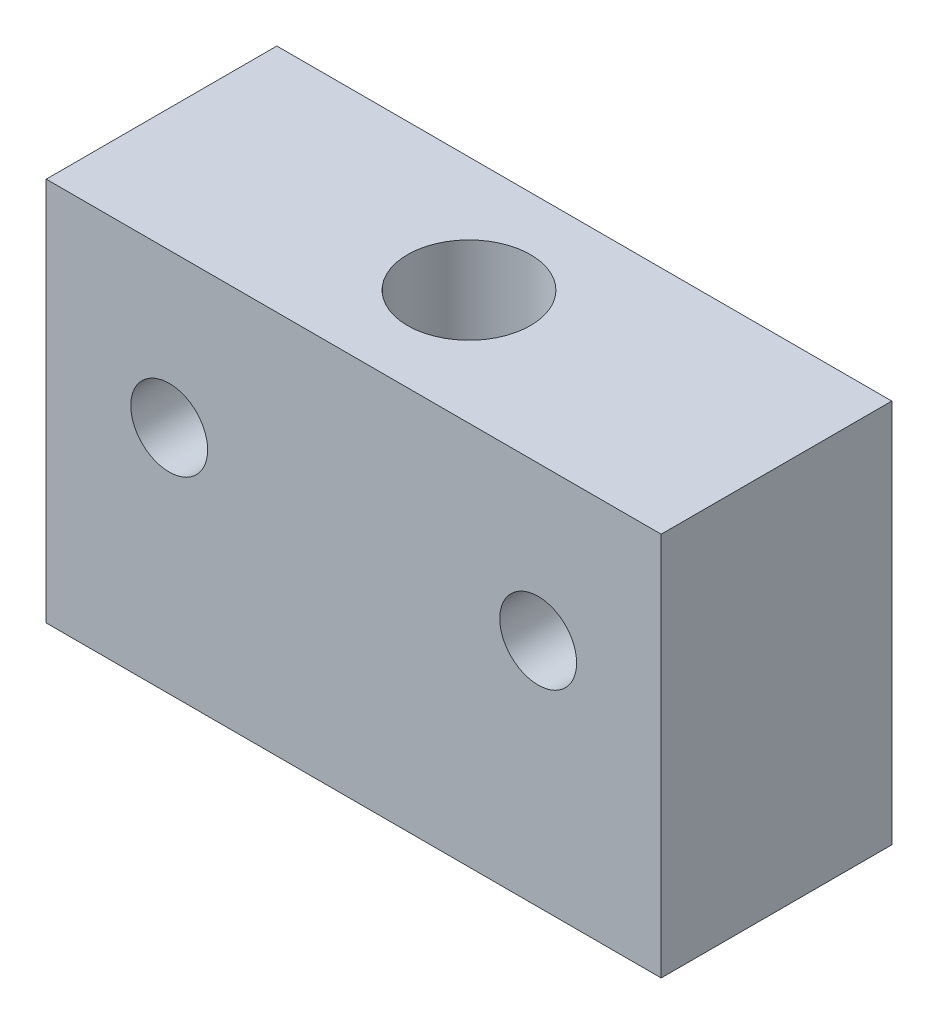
ISO-10303-21;
HEADER;
FILE_DESCRIPTION(('STEP AP214'),'2;1');
FILE_NAME('part.step','',(''),(''),'','','');
FILE_SCHEMA(('AUTOMOTIVE_DESIGN { 1 0 10303 214 1 1 1 1 }'));
ENDSEC;
DATA;
#1=APPLICATION_CONTEXT('core data for automotive mechanical design processes');
#2=APPLICATION_PROTOCOL_DEFINITION('international standard','automotive_design',2000,#1);
#3=PRODUCT_CONTEXT('',#1,'mechanical');
#4=PRODUCT('Part','Part','',(#3));
#5=PRODUCT_RELATED_PRODUCT_CATEGORY('part','',(#4));
#6=PRODUCT_DEFINITION_FORMATION('','',#4);
#7=PRODUCT_DEFINITION_CONTEXT('part definition',#1,'design');
#8=PRODUCT_DEFINITION('design','',#6,#7);
#9=PRODUCT_DEFINITION_SHAPE('','',#8);
#10=(LENGTH_UNIT() NAMED_UNIT(*) SI_UNIT(.MILLI.,.METRE.));
#11=(NAMED_UNIT(*) PLANE_ANGLE_UNIT() SI_UNIT($,.RADIAN.));
#12=(NAMED_UNIT(*) SI_UNIT($,.STERADIAN.) SOLID_ANGLE_UNIT());
#13=UNCERTAINTY_MEASURE_WITH_UNIT(LENGTH_MEASURE(1.E-05),#10,'distance_accuracy_value','');
#14=(GEOMETRIC_REPRESENTATION_CONTEXT(3) GLOBAL_UNCERTAINTY_ASSIGNED_CONTEXT((#13)) GLOBAL_UNIT_ASSIGNED_CONTEXT((#10,
#11,#12)) REPRESENTATION_CONTEXT('',''));
#15=CARTESIAN_POINT('',(0.,0.,0.));
#16=DIRECTION('',(0.,0.,1.));
#17=DIRECTION('',(1.,0.,0.));
#18=AXIS2_PLACEMENT_3D('',#15,#16,#17);
#19=CARTESIAN_POINT('',(-69.9731301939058,23.6234072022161,15.));
#20=DIRECTION('',(1.,0.,0.));
#21=DIRECTION('',(0.,0.,-1.));
#22=AXIS2_PLACEMENT_3D('',#19,#20,#21);
#23=PLANE('',#22);
#24=DIRECTION('',(0.,-1.,0.));
#25=VECTOR('',#24,1.);
#26=CARTESIAN_POINT('',(-69.9731301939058,23.6234072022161,0.));
#27=LINE('',#26,#25);
#28=CARTESIAN_POINT('',(-69.9731301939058,23.6234072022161,0.));
#29=VERTEX_POINT('',#28);
#30=CARTESIAN_POINT('',(-69.9731301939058,-1.37659279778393,0.));
#31=VERTEX_POINT('',#30);
#32=EDGE_CURVE('E70',#29,#31,#27,.T.);
#33=ORIENTED_EDGE('',*,*,#32,.T.);
#34=DIRECTION('',(0.,0.,-1.));
#35=VECTOR('',#34,1.);
#36=CARTESIAN_POINT('',(-69.9731301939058,-1.37659279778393,15.));
#37=LINE('',#36,#35);
#38=CARTESIAN_POINT('',(-69.9731301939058,-1.37659279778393,15.));
#39=VERTEX_POINT('',#38);
#40=EDGE_CURVE('E11',#39,#31,#37,.T.);
#41=ORIENTED_EDGE('',*,*,#40,.F.);
#42=DIRECTION('',(0.,-1.,0.));
#43=VECTOR('',#42,1.);
#44=CARTESIAN_POINT('',(-69.9731301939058,23.6234072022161,15.));
#45=LINE('',#44,#43);
#46=CARTESIAN_POINT('',(-69.9731301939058,23.6234072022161,15.));
#47=VERTEX_POINT('',#46);
#48=EDGE_CURVE('E93',#47,#39,#45,.T.);
#49=ORIENTED_EDGE('',*,*,#48,.F.);
#50=DIRECTION('',(0.,0.,-1.));
#51=VECTOR('',#50,1.);
#52=CARTESIAN_POINT('',(-69.9731301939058,23.6234072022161,15.));
#53=LINE('',#52,#51);
#54=EDGE_CURVE('E82',#47,#29,#53,.T.);
#55=ORIENTED_EDGE('',*,*,#54,.T.);
#56=EDGE_LOOP('',(#33,#41,#49,#55));
#57=FACE_BOUND('',#56,.T.);
#58=ADVANCED_FACE('F24',(#57),#23,.F.);
#59=CARTESIAN_POINT('',(-69.9731301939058,-1.37659279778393,15.));
#60=DIRECTION('',(0.,1.,0.));
#61=DIRECTION('',(0.,0.,1.));
#62=AXIS2_PLACEMENT_3D('',#59,#60,#61);
#63=PLANE('',#62);
#64=CARTESIAN_POINT('',(-49.9731301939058,-1.37659279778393,7.50000000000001));
#65=DIRECTION('',(0.,1.,0.));
#66=DIRECTION('',(0.,0.,1.));
#67=AXIS2_PLACEMENT_3D('',#64,#65,#66);
#68=CIRCLE('',#67,4.);
#69=CARTESIAN_POINT('',(-49.9731301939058,-1.37659279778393,11.5));
#70=VERTEX_POINT('',#69);
#71=EDGE_CURVE('E83',#70,#70,#68,.T.);
#72=ORIENTED_EDGE('',*,*,#71,.T.);
#73=EDGE_LOOP('',(#72));
#74=FACE_BOUND('',#73,.T.);
#75=DIRECTION('',(1.,0.,0.));
#76=VECTOR('',#75,1.);
#77=CARTESIAN_POINT('',(-69.9731301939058,-1.37659279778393,0.));
#78=LINE('',#77,#76);
#79=CARTESIAN_POINT('',(-29.9731301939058,-1.37659279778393,0.));
#80=VERTEX_POINT('',#79);
#81=EDGE_CURVE('E66',#31,#80,#78,.T.);
#82=ORIENTED_EDGE('',*,*,#81,.T.);
#83=DIRECTION('',(0.,0.,-1.));
#84=VECTOR('',#83,1.);
#85=CARTESIAN_POINT('',(-29.9731301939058,-1.37659279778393,15.));
#86=LINE('',#85,#84);
#87=CARTESIAN_POINT('',(-29.9731301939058,-1.37659279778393,15.));
#88=VERTEX_POINT('',#87);
#89=EDGE_CURVE('E32',#88,#80,#86,.T.);
#90=ORIENTED_EDGE('',*,*,#89,.F.);
#91=DIRECTION('',(1.,0.,0.));
#92=VECTOR('',#91,1.);
#93=CARTESIAN_POINT('',(-69.9731301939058,-1.37659279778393,15.));
#94=LINE('',#93,#92);
#95=EDGE_CURVE('E78',#39,#88,#94,.T.);
#96=ORIENTED_EDGE('',*,*,#95,.F.);
#97=ORIENTED_EDGE('',*,*,#40,.T.);
#98=EDGE_LOOP('',(#82,#90,#96,#97));
#99=FACE_BOUND('',#98,.T.);
#100=ADVANCED_FACE('F77',(#74,#99),#63,.F.);
#101=CARTESIAN_POINT('',(-29.9731301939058,23.6234072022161,15.));
#102=DIRECTION('',(-1.,0.,0.));
#103=DIRECTION('',(0.,-1.,0.));
#104=AXIS2_PLACEMENT_3D('',#101,#102,#103);
#105=PLANE('',#104);
#106=DIRECTION('',(0.,1.,0.));
#107=VECTOR('',#106,1.);
#108=CARTESIAN_POINT('',(-29.9731301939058,23.6234072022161,0.));
#109=LINE('',#108,#107);
#110=CARTESIAN_POINT('',(-29.9731301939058,23.6234072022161,0.));
#111=VERTEX_POINT('',#110);
#112=EDGE_CURVE('E71',#80,#111,#109,.T.);
#113=ORIENTED_EDGE('',*,*,#112,.T.);
#114=DIRECTION('',(0.,0.,-1.));
#115=VECTOR('',#114,1.);
#116=CARTESIAN_POINT('',(-29.9731301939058,23.6234072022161,15.));
#117=LINE('',#116,#115);
#118=CARTESIAN_POINT('',(-29.9731301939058,23.6234072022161,15.));
#119=VERTEX_POINT('',#118);
#120=EDGE_CURVE('E99',#119,#111,#117,.T.);
#121=ORIENTED_EDGE('',*,*,#120,.F.);
#122=DIRECTION('',(0.,1.,0.));
#123=VECTOR('',#122,1.);
#124=CARTESIAN_POINT('',(-29.9731301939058,23.6234072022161,15.));
#125=LINE('',#124,#123);
#126=EDGE_CURVE('E45',#88,#119,#125,.T.);
#127=ORIENTED_EDGE('',*,*,#126,.F.);
#128=ORIENTED_EDGE('',*,*,#89,.T.);
#129=EDGE_LOOP('',(#113,#121,#127,#128));
#130=FACE_BOUND('',#129,.T.);
#131=ADVANCED_FACE('F127',(#130),#105,.F.);
#132=CARTESIAN_POINT('',(-69.9731301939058,23.6234072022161,15.));
#133=DIRECTION('',(0.,-1.,0.));
#134=DIRECTION('',(0.,0.,-1.));
#135=AXIS2_PLACEMENT_3D('',#132,#133,#134);
#136=PLANE('',#135);
#137=CARTESIAN_POINT('',(-49.9731301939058,23.6234072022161,7.50000000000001));
#138=DIRECTION('',(0.,1.,0.));
#139=DIRECTION('',(0.,0.,1.));
#140=AXIS2_PLACEMENT_3D('',#137,#138,#139);
#141=CIRCLE('',#140,4.);
#142=CARTESIAN_POINT('',(-49.9731301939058,23.6234072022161,11.5));
#143=VERTEX_POINT('',#142);
#144=EDGE_CURVE('E86',#143,#143,#141,.T.);
#145=ORIENTED_EDGE('',*,*,#144,.F.);
#146=EDGE_LOOP('',(#145));
#147=FACE_BOUND('',#146,.T.);
#148=DIRECTION('',(-1.,0.,0.));
#149=VECTOR('',#148,1.);
#150=CARTESIAN_POINT('',(-69.9731301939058,23.6234072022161,0.));
#151=LINE('',#150,#149);
#152=EDGE_CURVE('E91',#111,#29,#151,.T.);
#153=ORIENTED_EDGE('',*,*,#152,.T.);
#154=ORIENTED_EDGE('',*,*,#54,.F.);
#155=DIRECTION('',(-1.,0.,0.));
#156=VECTOR('',#155,1.);
#157=CARTESIAN_POINT('',(-69.9731301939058,23.6234072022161,15.));
#158=LINE('',#157,#156);
#159=EDGE_CURVE('E40',#119,#47,#158,.T.);
#160=ORIENTED_EDGE('',*,*,#159,.F.);
#161=ORIENTED_EDGE('',*,*,#120,.T.);
#162=EDGE_LOOP('',(#153,#154,#160,#161));
#163=FACE_BOUND('',#162,.T.);
#164=ADVANCED_FACE('F124',(#147,#163),#136,.F.);
#165=CARTESIAN_POINT('',(-69.9731301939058,-1.37659279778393,15.));
#166=DIRECTION('',(0.,0.,1.));
#167=DIRECTION('',(1.,0.,0.));
#168=AXIS2_PLACEMENT_3D('',#165,#166,#167);
#169=PLANE('',#168);
#170=CARTESIAN_POINT('',(-61.9731301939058,13.6234072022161,15.));
#171=DIRECTION('',(0.,0.,1.));
#172=DIRECTION('',(1.,0.,0.));
#173=AXIS2_PLACEMENT_3D('',#170,#171,#172);
#174=CIRCLE('',#173,2.49999999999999);
#175=CARTESIAN_POINT('',(-59.4731301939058,13.6234072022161,15.));
#176=VERTEX_POINT('',#175);
#177=EDGE_CURVE('E113',#176,#176,#174,.T.);
#178=ORIENTED_EDGE('',*,*,#177,.F.);
#179=EDGE_LOOP('',(#178));
#180=FACE_BOUND('',#179,.T.);
#181=CARTESIAN_POINT('',(-37.9731301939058,13.6234072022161,15.));
#182=DIRECTION('',(0.,0.,1.));
#183=DIRECTION('',(1.,0.,0.));
#184=AXIS2_PLACEMENT_3D('',#181,#182,#183);
#185=CIRCLE('',#184,2.49999999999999);
#186=CARTESIAN_POINT('',(-35.4731301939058,13.6234072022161,15.));
#187=VERTEX_POINT('',#186);
#188=EDGE_CURVE('E104',#187,#187,#185,.T.);
#189=ORIENTED_EDGE('',*,*,#188,.F.);
#190=EDGE_LOOP('',(#189));
#191=FACE_BOUND('',#190,.T.);
#192=ORIENTED_EDGE('',*,*,#48,.T.);
#193=ORIENTED_EDGE('',*,*,#95,.T.);
#194=ORIENTED_EDGE('',*,*,#126,.T.);
#195=ORIENTED_EDGE('',*,*,#159,.T.);
#196=EDGE_LOOP('',(#192,#193,#194,#195));
#197=FACE_BOUND('',#196,.T.);
#198=ADVANCED_FACE('F121',(#180,#191,#197),#169,.T.);
#199=CARTESIAN_POINT('',(-69.9731301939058,-1.37659279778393,0.));
#200=DIRECTION('',(0.,0.,1.));
#201=DIRECTION('',(1.,0.,0.));
#202=AXIS2_PLACEMENT_3D('',#199,#200,#201);
#203=PLANE('',#202);
#204=CARTESIAN_POINT('',(-61.9731301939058,13.6234072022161,0.));
#205=DIRECTION('',(0.,0.,1.));
#206=DIRECTION('',(1.,0.,0.));
#207=AXIS2_PLACEMENT_3D('',#204,#205,#206);
#208=CIRCLE('',#207,2.49999999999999);
#209=CARTESIAN_POINT('',(-59.4731301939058,13.6234072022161,0.));
#210=VERTEX_POINT('',#209);
#211=EDGE_CURVE('E27',#210,#210,#208,.T.);
#212=ORIENTED_EDGE('',*,*,#211,.T.);
#213=EDGE_LOOP('',(#212));
#214=FACE_BOUND('',#213,.T.);
#215=CARTESIAN_POINT('',(-37.9731301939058,13.6234072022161,0.));
#216=DIRECTION('',(0.,0.,1.));
#217=DIRECTION('',(1.,0.,0.));
#218=AXIS2_PLACEMENT_3D('',#215,#216,#217);
#219=CIRCLE('',#218,2.49999999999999);
#220=CARTESIAN_POINT('',(-35.4731301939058,13.6234072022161,0.));
#221=VERTEX_POINT('',#220);
#222=EDGE_CURVE('E102',#221,#221,#219,.T.);
#223=ORIENTED_EDGE('',*,*,#222,.T.);
#224=EDGE_LOOP('',(#223));
#225=FACE_BOUND('',#224,.T.);
#226=ORIENTED_EDGE('',*,*,#32,.F.);
#227=ORIENTED_EDGE('',*,*,#152,.F.);
#228=ORIENTED_EDGE('',*,*,#112,.F.);
#229=ORIENTED_EDGE('',*,*,#81,.F.);
#230=EDGE_LOOP('',(#226,#227,#228,#229));
#231=FACE_BOUND('',#230,.T.);
#232=ADVANCED_FACE('F67',(#214,#225,#231),#203,.F.);
#233=CARTESIAN_POINT('',(-49.9731301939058,-11.3765927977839,7.50000000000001));
#234=DIRECTION('',(0.,1.,0.));
#235=DIRECTION('',(0.,0.,1.));
#236=AXIS2_PLACEMENT_3D('',#233,#234,#235);
#237=CYLINDRICAL_SURFACE('',#236,4.);
#238=ORIENTED_EDGE('',*,*,#144,.T.);
#239=EDGE_LOOP('',(#238));
#240=FACE_BOUND('',#239,.T.);
#241=ORIENTED_EDGE('',*,*,#71,.F.);
#242=EDGE_LOOP('',(#241));
#243=FACE_BOUND('',#242,.T.);
#244=ADVANCED_FACE('F146',(#240,#243),#237,.F.);
#245=CARTESIAN_POINT('',(-37.9731301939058,13.6234072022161,15.));
#246=DIRECTION('',(0.,0.,1.));
#247=DIRECTION('',(1.,0.,0.));
#248=AXIS2_PLACEMENT_3D('',#245,#246,#247);
#249=CYLINDRICAL_SURFACE('',#248,2.49999999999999);
#250=ORIENTED_EDGE('',*,*,#188,.T.);
#251=EDGE_LOOP('',(#250));
#252=FACE_BOUND('',#251,.T.);
#253=ORIENTED_EDGE('',*,*,#222,.F.);
#254=EDGE_LOOP('',(#253));
#255=FACE_BOUND('',#254,.T.);
#256=ADVANCED_FACE('F148',(#252,#255),#249,.F.);
#257=CARTESIAN_POINT('',(-61.9731301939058,13.6234072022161,15.));
#258=DIRECTION('',(0.,0.,1.));
#259=DIRECTION('',(1.,0.,0.));
#260=AXIS2_PLACEMENT_3D('',#257,#258,#259);
#261=CYLINDRICAL_SURFACE('',#260,2.49999999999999);
#262=ORIENTED_EDGE('',*,*,#177,.T.);
#263=EDGE_LOOP('',(#262));
#264=FACE_BOUND('',#263,.T.);
#265=ORIENTED_EDGE('',*,*,#211,.F.);
#266=EDGE_LOOP('',(#265));
#267=FACE_BOUND('',#266,.T.);
#268=ADVANCED_FACE('F118',(#264,#267),#261,.F.);
#269=CLOSED_SHELL('',(#58,#100,#131,#164,#198,#232,#244,#256,#268));
#270=MANIFOLD_SOLID_BREP('B2',#269);
#271=ADVANCED_BREP_SHAPE_REPRESENTATION('',(#18,#270),#14);
#272=SHAPE_DEFINITION_REPRESENTATION(#9,#271);
ENDSEC;
END-ISO-10303-21;
